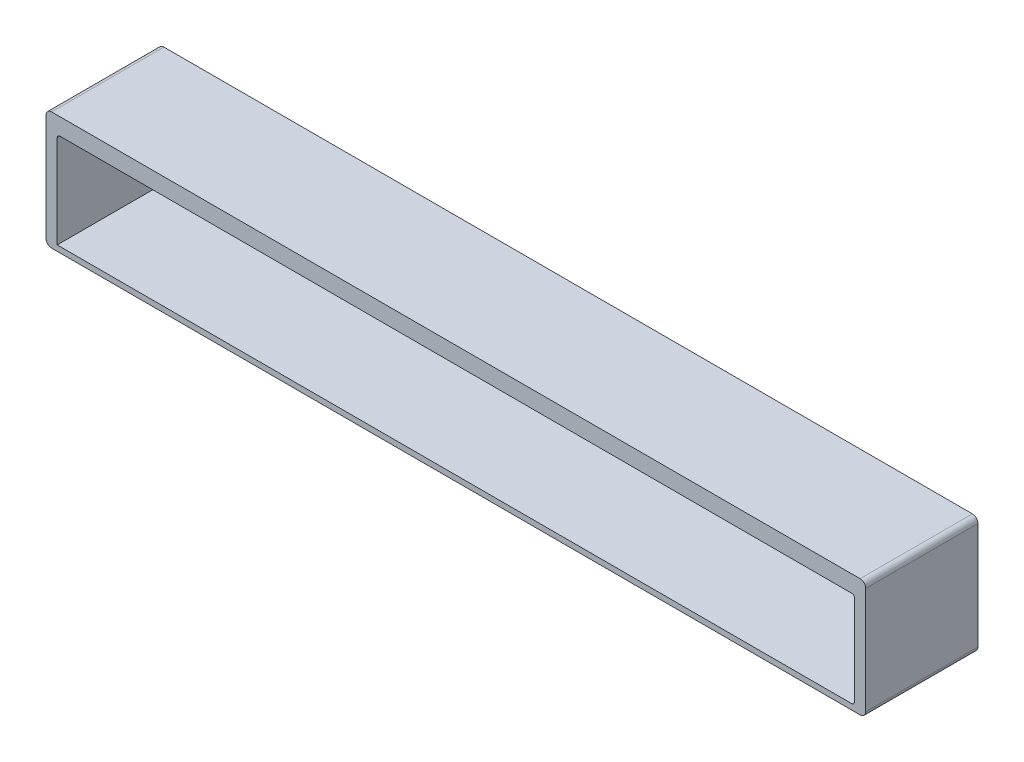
ISO-10303-21;
HEADER;
FILE_DESCRIPTION(('STEP AP214'),'2;1');
FILE_NAME('part.step','',(''),(''),'','','');
FILE_SCHEMA(('AUTOMOTIVE_DESIGN { 1 0 10303 214 1 1 1 1 }'));
ENDSEC;
DATA;
#1=APPLICATION_CONTEXT('core data for automotive mechanical design processes');
#2=APPLICATION_PROTOCOL_DEFINITION('international standard','automotive_design',2000,#1);
#3=PRODUCT_CONTEXT('',#1,'mechanical');
#4=PRODUCT('Part','Part','',(#3));
#5=PRODUCT_RELATED_PRODUCT_CATEGORY('part','',(#4));
#6=PRODUCT_DEFINITION_FORMATION('','',#4);
#7=PRODUCT_DEFINITION_CONTEXT('part definition',#1,'design');
#8=PRODUCT_DEFINITION('design','',#6,#7);
#9=PRODUCT_DEFINITION_SHAPE('','',#8);
#10=(LENGTH_UNIT() NAMED_UNIT(*) SI_UNIT(.MILLI.,.METRE.));
#11=(NAMED_UNIT(*) PLANE_ANGLE_UNIT() SI_UNIT($,.RADIAN.));
#12=(NAMED_UNIT(*) SI_UNIT($,.STERADIAN.) SOLID_ANGLE_UNIT());
#13=UNCERTAINTY_MEASURE_WITH_UNIT(LENGTH_MEASURE(1.E-05),#10,'distance_accuracy_value','');
#14=(GEOMETRIC_REPRESENTATION_CONTEXT(3) GLOBAL_UNCERTAINTY_ASSIGNED_CONTEXT((#13)) GLOBAL_UNIT_ASSIGNED_CONTEXT((#10,
#11,#12)) REPRESENTATION_CONTEXT('',''));
#15=CARTESIAN_POINT('',(0.,0.,0.));
#16=DIRECTION('',(0.,0.,1.));
#17=DIRECTION('',(1.,0.,0.));
#18=AXIS2_PLACEMENT_3D('',#15,#16,#17);
#19=CARTESIAN_POINT('',(-88.2099650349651,-6.1076923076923,-12.6188488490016));
#20=DIRECTION('',(0.,0.,-1.));
#21=DIRECTION('',(-1.,0.,0.));
#22=AXIS2_PLACEMENT_3D('',#19,#20,#21);
#23=PLANE('',#22);
#24=DIRECTION('',(0.,1.,0.));
#25=VECTOR('',#24,1.);
#26=CARTESIAN_POINT('',(-19.2099650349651,-104.00394301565,-12.6188488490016));
#27=LINE('',#26,#25);
#28=CARTESIAN_POINT('',(-19.2099650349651,-15.8670699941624,-12.6188488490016));
#29=VERTEX_POINT('',#28);
#30=CARTESIAN_POINT('',(-19.2099650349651,-7.8576923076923,-12.6188488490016));
#31=VERTEX_POINT('',#30);
#32=EDGE_CURVE('E180',#29,#31,#27,.T.);
#33=ORIENTED_EDGE('',*,*,#32,.F.);
#34=CARTESIAN_POINT('',(-19.4599650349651,-15.8670699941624,-12.6188488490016));
#35=DIRECTION('',(0.,0.,-1.));
#36=DIRECTION('',(-1.,0.,0.));
#37=AXIS2_PLACEMENT_3D('',#34,#35,#36);
#38=CIRCLE('',#37,0.25);
#39=CARTESIAN_POINT('',(-19.4599650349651,-16.1170699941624,-12.6188488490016));
#40=VERTEX_POINT('',#39);
#41=EDGE_CURVE('E142',#29,#40,#38,.T.);
#42=ORIENTED_EDGE('',*,*,#41,.T.);
#43=DIRECTION('',(-1.,0.,0.));
#44=VECTOR('',#43,1.);
#45=CARTESIAN_POINT('',(-18.2099650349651,-16.1170699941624,-12.6188488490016));
#46=LINE('',#45,#44);
#47=CARTESIAN_POINT('',(-90.2099650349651,-16.1170699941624,-12.6188488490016));
#48=VERTEX_POINT('',#47);
#49=EDGE_CURVE('E136',#40,#48,#46,.T.);
#50=ORIENTED_EDGE('',*,*,#49,.T.);
#51=DIRECTION('',(0.,1.,0.));
#52=VECTOR('',#51,1.);
#53=CARTESIAN_POINT('',(-90.2099650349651,-104.00394301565,-12.6188488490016));
#54=LINE('',#53,#52);
#55=CARTESIAN_POINT('',(-90.2099650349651,-7.8576923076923,-12.6188488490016));
#56=VERTEX_POINT('',#55);
#57=EDGE_CURVE('E140',#48,#56,#54,.T.);
#58=ORIENTED_EDGE('',*,*,#57,.T.);
#59=CARTESIAN_POINT('',(-89.9599650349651,-7.8576923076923,-12.6188488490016));
#60=DIRECTION('',(0.,0.,-1.));
#61=DIRECTION('',(-1.,0.,0.));
#62=AXIS2_PLACEMENT_3D('',#59,#60,#61);
#63=CIRCLE('',#62,0.25);
#64=CARTESIAN_POINT('',(-89.9599650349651,-7.60769230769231,-12.6188488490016));
#65=VERTEX_POINT('',#64);
#66=EDGE_CURVE('E411',#56,#65,#63,.T.);
#67=ORIENTED_EDGE('',*,*,#66,.T.);
#68=DIRECTION('',(1.,0.,0.));
#69=VECTOR('',#68,1.);
#70=CARTESIAN_POINT('',(-88.2099650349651,-7.60769230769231,-12.6188488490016));
#71=LINE('',#70,#69);
#72=CARTESIAN_POINT('',(-19.4599650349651,-7.60769230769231,-12.6188488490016));
#73=VERTEX_POINT('',#72);
#74=EDGE_CURVE('E162',#65,#73,#71,.T.);
#75=ORIENTED_EDGE('',*,*,#74,.T.);
#76=CARTESIAN_POINT('',(-19.4599650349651,-7.8576923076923,-12.6188488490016));
#77=DIRECTION('',(0.,0.,-1.));
#78=DIRECTION('',(-1.,0.,0.));
#79=AXIS2_PLACEMENT_3D('',#76,#77,#78);
#80=CIRCLE('',#79,0.25);
#81=EDGE_CURVE('E11',#73,#31,#80,.T.);
#82=ORIENTED_EDGE('',*,*,#81,.T.);
#83=EDGE_LOOP('',(#33,#42,#50,#58,#67,#75,#82));
#84=FACE_BOUND('',#83,.T.);
#85=DIRECTION('',(0.,1.,0.));
#86=VECTOR('',#85,1.);
#87=CARTESIAN_POINT('',(-18.2099650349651,-104.00394301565,-12.6188488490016));
#88=LINE('',#87,#86);
#89=CARTESIAN_POINT('',(-18.2099650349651,-16.1170699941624,-12.6188488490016));
#90=VERTEX_POINT('',#89);
#91=CARTESIAN_POINT('',(-18.2099650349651,-6.6076923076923,-12.6188488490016));
#92=VERTEX_POINT('',#91);
#93=EDGE_CURVE('E156',#90,#92,#88,.T.);
#94=ORIENTED_EDGE('',*,*,#93,.T.);
#95=CARTESIAN_POINT('',(-18.7099650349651,-6.6076923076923,-12.6188488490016));
#96=DIRECTION('',(0.,0.,-1.));
#97=DIRECTION('',(-1.,0.,0.));
#98=AXIS2_PLACEMENT_3D('',#95,#96,#97);
#99=CIRCLE('',#98,0.5);
#100=CARTESIAN_POINT('',(-18.7099650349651,-6.1076923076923,-12.6188488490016));
#101=VERTEX_POINT('',#100);
#102=EDGE_CURVE('E212',#92,#101,#99,.F.);
#103=ORIENTED_EDGE('',*,*,#102,.T.);
#104=DIRECTION('',(-1.,0.,0.));
#105=VECTOR('',#104,1.);
#106=CARTESIAN_POINT('',(-88.2099650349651,-6.1076923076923,-12.6188488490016));
#107=LINE('',#106,#105);
#108=CARTESIAN_POINT('',(-90.7099650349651,-6.1076923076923,-12.6188488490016));
#109=VERTEX_POINT('',#108);
#110=EDGE_CURVE('E165',#101,#109,#107,.T.);
#111=ORIENTED_EDGE('',*,*,#110,.T.);
#112=CARTESIAN_POINT('',(-90.7099650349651,-6.6076923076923,-12.6188488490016));
#113=DIRECTION('',(0.,0.,-1.));
#114=DIRECTION('',(-1.,0.,0.));
#115=AXIS2_PLACEMENT_3D('',#112,#113,#114);
#116=CIRCLE('',#115,0.5);
#117=CARTESIAN_POINT('',(-91.2099650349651,-6.6076923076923,-12.6188488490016));
#118=VERTEX_POINT('',#117);
#119=EDGE_CURVE('E210',#109,#118,#116,.F.);
#120=ORIENTED_EDGE('',*,*,#119,.T.);
#121=DIRECTION('',(0.,1.,0.));
#122=VECTOR('',#121,1.);
#123=CARTESIAN_POINT('',(-91.2099650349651,-104.00394301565,-12.6188488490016));
#124=LINE('',#123,#122);
#125=CARTESIAN_POINT('',(-91.2099650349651,-16.1170699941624,-12.6188488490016));
#126=VERTEX_POINT('',#125);
#127=EDGE_CURVE('E168',#126,#118,#124,.T.);
#128=ORIENTED_EDGE('',*,*,#127,.F.);
#129=CARTESIAN_POINT('',(-90.7099650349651,-16.1170699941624,-12.6188488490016));
#130=DIRECTION('',(0.,0.,-1.));
#131=DIRECTION('',(-1.,0.,0.));
#132=AXIS2_PLACEMENT_3D('',#129,#130,#131);
#133=CIRCLE('',#132,0.5);
#134=CARTESIAN_POINT('',(-90.7099650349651,-16.6170699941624,-12.6188488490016));
#135=VERTEX_POINT('',#134);
#136=EDGE_CURVE('E208',#126,#135,#133,.F.);
#137=ORIENTED_EDGE('',*,*,#136,.T.);
#138=DIRECTION('',(1.,0.,0.));
#139=VECTOR('',#138,1.);
#140=CARTESIAN_POINT('',(-90.2099650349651,-16.6170699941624,-12.6188488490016));
#141=LINE('',#140,#139);
#142=CARTESIAN_POINT('',(-18.7099650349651,-16.6170699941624,-12.6188488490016));
#143=VERTEX_POINT('',#142);
#144=EDGE_CURVE('E163',#135,#143,#141,.T.);
#145=ORIENTED_EDGE('',*,*,#144,.T.);
#146=CARTESIAN_POINT('',(-18.7099650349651,-16.1170699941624,-12.6188488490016));
#147=DIRECTION('',(0.,0.,-1.));
#148=DIRECTION('',(-1.,0.,0.));
#149=AXIS2_PLACEMENT_3D('',#146,#147,#148);
#150=CIRCLE('',#149,0.5);
#151=EDGE_CURVE('E206',#143,#90,#150,.F.);
#152=ORIENTED_EDGE('',*,*,#151,.T.);
#153=EDGE_LOOP('',(#94,#103,#111,#120,#128,#137,#145,#152));
#154=FACE_BOUND('',#153,.T.);
#155=ADVANCED_FACE('F30',(#84,#154),#23,.F.);
#156=CARTESIAN_POINT('',(-88.2099650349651,-7.60769230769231,-166.016788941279));
#157=DIRECTION('',(0.,-1.,0.));
#158=DIRECTION('',(0.,0.,-1.));
#159=AXIS2_PLACEMENT_3D('',#156,#157,#158);
#160=PLANE('',#159);
#161=ORIENTED_EDGE('',*,*,#74,.F.);
#162=DIRECTION('',(0.,0.,1.));
#163=VECTOR('',#162,1.);
#164=CARTESIAN_POINT('',(-89.9599650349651,-7.60769230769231,-22.6188488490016));
#165=LINE('',#164,#163);
#166=CARTESIAN_POINT('',(-89.9599650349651,-7.60769230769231,-22.6188488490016));
#167=VERTEX_POINT('',#166);
#168=EDGE_CURVE('E226',#65,#167,#165,.F.);
#169=ORIENTED_EDGE('',*,*,#168,.T.);
#170=DIRECTION('',(-1.,0.,0.));
#171=VECTOR('',#170,1.);
#172=CARTESIAN_POINT('',(-88.2099650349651,-7.60769230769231,-22.6188488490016));
#173=LINE('',#172,#171);
#174=CARTESIAN_POINT('',(-19.4599650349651,-7.60769230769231,-22.6188488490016));
#175=VERTEX_POINT('',#174);
#176=EDGE_CURVE('E242',#175,#167,#173,.T.);
#177=ORIENTED_EDGE('',*,*,#176,.F.);
#178=DIRECTION('',(0.,0.,-1.));
#179=VECTOR('',#178,1.);
#180=CARTESIAN_POINT('',(-19.4599650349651,-7.60769230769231,-12.6188488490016));
#181=LINE('',#180,#179);
#182=EDGE_CURVE('E223',#175,#73,#181,.F.);
#183=ORIENTED_EDGE('',*,*,#182,.T.);
#184=EDGE_LOOP('',(#161,#169,#177,#183));
#185=FACE_BOUND('',#184,.T.);
#186=ADVANCED_FACE('F301',(#185),#160,.T.);
#187=CARTESIAN_POINT('',(-88.2099650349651,-6.1076923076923,-166.016788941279));
#188=DIRECTION('',(0.,1.,0.));
#189=DIRECTION('',(0.,0.,1.));
#190=AXIS2_PLACEMENT_3D('',#187,#188,#189);
#191=PLANE('',#190);
#192=ORIENTED_EDGE('',*,*,#110,.F.);
#193=DIRECTION('',(0.,0.,-1.));
#194=VECTOR('',#193,1.);
#195=CARTESIAN_POINT('',(-18.7099650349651,-6.1076923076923,-166.016788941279));
#196=LINE('',#195,#194);
#197=CARTESIAN_POINT('',(-18.7099650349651,-6.1076923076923,-22.6188488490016));
#198=VERTEX_POINT('',#197);
#199=EDGE_CURVE('E186',#101,#198,#196,.T.);
#200=ORIENTED_EDGE('',*,*,#199,.T.);
#201=DIRECTION('',(1.,0.,0.));
#202=VECTOR('',#201,1.);
#203=CARTESIAN_POINT('',(-88.2099650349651,-6.1076923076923,-22.6188488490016));
#204=LINE('',#203,#202);
#205=CARTESIAN_POINT('',(-90.7099650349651,-6.1076923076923,-22.6188488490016));
#206=VERTEX_POINT('',#205);
#207=EDGE_CURVE('E147',#206,#198,#204,.T.);
#208=ORIENTED_EDGE('',*,*,#207,.F.);
#209=DIRECTION('',(0.,0.,1.));
#210=VECTOR('',#209,1.);
#211=CARTESIAN_POINT('',(-90.7099650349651,-6.1076923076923,-166.016788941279));
#212=LINE('',#211,#210);
#213=EDGE_CURVE('E183',#206,#109,#212,.T.);
#214=ORIENTED_EDGE('',*,*,#213,.T.);
#215=EDGE_LOOP('',(#192,#200,#208,#214));
#216=FACE_BOUND('',#215,.T.);
#217=ADVANCED_FACE('F266',(#216),#191,.T.);
#218=CARTESIAN_POINT('',(-98.7668120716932,-16.6170699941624,-99.));
#219=DIRECTION('',(0.,-1.,0.));
#220=DIRECTION('',(0.,0.,-1.));
#221=AXIS2_PLACEMENT_3D('',#218,#219,#220);
#222=PLANE('',#221);
#223=ORIENTED_EDGE('',*,*,#144,.F.);
#224=DIRECTION('',(0.,0.,1.));
#225=VECTOR('',#224,1.);
#226=CARTESIAN_POINT('',(-90.7099650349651,-16.6170699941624,-99.));
#227=LINE('',#226,#225);
#228=CARTESIAN_POINT('',(-90.7099650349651,-16.6170699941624,-22.6188488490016));
#229=VERTEX_POINT('',#228);
#230=EDGE_CURVE('E221',#135,#229,#227,.F.);
#231=ORIENTED_EDGE('',*,*,#230,.T.);
#232=DIRECTION('',(-1.,0.,0.));
#233=VECTOR('',#232,1.);
#234=CARTESIAN_POINT('',(-98.7668120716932,-16.6170699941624,-22.6188488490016));
#235=LINE('',#234,#233);
#236=CARTESIAN_POINT('',(-18.7099650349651,-16.6170699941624,-22.6188488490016));
#237=VERTEX_POINT('',#236);
#238=EDGE_CURVE('E239',#237,#229,#235,.T.);
#239=ORIENTED_EDGE('',*,*,#238,.F.);
#240=DIRECTION('',(0.,0.,-1.));
#241=VECTOR('',#240,1.);
#242=CARTESIAN_POINT('',(-18.7099650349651,-16.6170699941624,-99.));
#243=LINE('',#242,#241);
#244=EDGE_CURVE('E219',#237,#143,#243,.F.);
#245=ORIENTED_EDGE('',*,*,#244,.T.);
#246=EDGE_LOOP('',(#223,#231,#239,#245));
#247=FACE_BOUND('',#246,.T.);
#248=ADVANCED_FACE('F284',(#247),#222,.T.);
#249=CARTESIAN_POINT('',(-91.2099650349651,-104.00394301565,-12.6188488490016));
#250=DIRECTION('',(-1.,0.,0.));
#251=DIRECTION('',(0.,0.,1.));
#252=AXIS2_PLACEMENT_3D('',#249,#250,#251);
#253=PLANE('',#252);
#254=ORIENTED_EDGE('',*,*,#127,.T.);
#255=DIRECTION('',(0.,0.,1.));
#256=VECTOR('',#255,1.);
#257=CARTESIAN_POINT('',(-91.2099650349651,-6.6076923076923,-12.6188488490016));
#258=LINE('',#257,#256);
#259=CARTESIAN_POINT('',(-91.2099650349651,-6.6076923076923,-22.6188488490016));
#260=VERTEX_POINT('',#259);
#261=EDGE_CURVE('E217',#118,#260,#258,.F.);
#262=ORIENTED_EDGE('',*,*,#261,.T.);
#263=DIRECTION('',(0.,1.,0.));
#264=VECTOR('',#263,1.);
#265=CARTESIAN_POINT('',(-91.2099650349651,-40.6709312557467,-22.6188488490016));
#266=LINE('',#265,#264);
#267=CARTESIAN_POINT('',(-91.2099650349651,-16.1170699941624,-22.6188488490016));
#268=VERTEX_POINT('',#267);
#269=EDGE_CURVE('E251',#268,#260,#266,.T.);
#270=ORIENTED_EDGE('',*,*,#269,.F.);
#271=DIRECTION('',(0.,0.,1.));
#272=VECTOR('',#271,1.);
#273=CARTESIAN_POINT('',(-91.2099650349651,-16.1170699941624,-12.6188488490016));
#274=LINE('',#273,#272);
#275=EDGE_CURVE('E214',#268,#126,#274,.T.);
#276=ORIENTED_EDGE('',*,*,#275,.T.);
#277=EDGE_LOOP('',(#254,#262,#270,#276));
#278=FACE_BOUND('',#277,.T.);
#279=ADVANCED_FACE('F275',(#278),#253,.T.);
#280=CARTESIAN_POINT('',(-90.2099650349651,-104.00394301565,-12.6188488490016));
#281=DIRECTION('',(1.,0.,0.));
#282=DIRECTION('',(0.,0.,-1.));
#283=AXIS2_PLACEMENT_3D('',#280,#281,#282);
#284=PLANE('',#283);
#285=DIRECTION('',(0.,-1.,0.));
#286=VECTOR('',#285,1.);
#287=CARTESIAN_POINT('',(-90.2099650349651,-104.00394301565,-22.6188488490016));
#288=LINE('',#287,#286);
#289=CARTESIAN_POINT('',(-90.2099650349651,-7.8576923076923,-22.6188488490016));
#290=VERTEX_POINT('',#289);
#291=CARTESIAN_POINT('',(-90.2099650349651,-16.1170699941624,-22.6188488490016));
#292=VERTEX_POINT('',#291);
#293=EDGE_CURVE('E245',#290,#292,#288,.T.);
#294=ORIENTED_EDGE('',*,*,#293,.F.);
#295=DIRECTION('',(0.,0.,1.));
#296=VECTOR('',#295,1.);
#297=CARTESIAN_POINT('',(-90.2099650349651,-7.8576923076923,-12.6188488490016));
#298=LINE('',#297,#296);
#299=EDGE_CURVE('E161',#290,#56,#298,.T.);
#300=ORIENTED_EDGE('',*,*,#299,.T.);
#301=ORIENTED_EDGE('',*,*,#57,.F.);
#302=DIRECTION('',(0.,0.,1.));
#303=VECTOR('',#302,1.);
#304=CARTESIAN_POINT('',(-90.2099650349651,-16.1170699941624,-12.6188488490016));
#305=LINE('',#304,#303);
#306=EDGE_CURVE('E146',#292,#48,#305,.T.);
#307=ORIENTED_EDGE('',*,*,#306,.F.);
#308=EDGE_LOOP('',(#294,#300,#301,#307));
#309=FACE_BOUND('',#308,.T.);
#310=ADVANCED_FACE('F159',(#309),#284,.T.);
#311=CARTESIAN_POINT('',(-18.2099650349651,-104.00394301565,-12.6188488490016));
#312=DIRECTION('',(1.,0.,0.));
#313=DIRECTION('',(0.,0.,-1.));
#314=AXIS2_PLACEMENT_3D('',#311,#312,#313);
#315=PLANE('',#314);
#316=DIRECTION('',(0.,1.,0.));
#317=VECTOR('',#316,1.);
#318=CARTESIAN_POINT('',(-18.2099650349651,-40.6709312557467,-22.6188488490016));
#319=LINE('',#318,#317);
#320=CARTESIAN_POINT('',(-18.2099650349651,-16.1170699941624,-22.6188488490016));
#321=VERTEX_POINT('',#320);
#322=CARTESIAN_POINT('',(-18.2099650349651,-6.6076923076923,-22.6188488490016));
#323=VERTEX_POINT('',#322);
#324=EDGE_CURVE('E250',#321,#323,#319,.T.);
#325=ORIENTED_EDGE('',*,*,#324,.T.);
#326=DIRECTION('',(0.,0.,-1.));
#327=VECTOR('',#326,1.);
#328=CARTESIAN_POINT('',(-18.2099650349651,-6.6076923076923,-12.6188488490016));
#329=LINE('',#328,#327);
#330=EDGE_CURVE('E204',#323,#92,#329,.F.);
#331=ORIENTED_EDGE('',*,*,#330,.T.);
#332=ORIENTED_EDGE('',*,*,#93,.F.);
#333=DIRECTION('',(0.,0.,-1.));
#334=VECTOR('',#333,1.);
#335=CARTESIAN_POINT('',(-18.2099650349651,-16.1170699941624,-12.6188488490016));
#336=LINE('',#335,#334);
#337=EDGE_CURVE('E201',#90,#321,#336,.T.);
#338=ORIENTED_EDGE('',*,*,#337,.T.);
#339=EDGE_LOOP('',(#325,#331,#332,#338));
#340=FACE_BOUND('',#339,.T.);
#341=ADVANCED_FACE('F258',(#340),#315,.T.);
#342=CARTESIAN_POINT('',(-19.2099650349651,-104.00394301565,-12.6188488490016));
#343=DIRECTION('',(-1.,0.,0.));
#344=DIRECTION('',(0.,0.,1.));
#345=AXIS2_PLACEMENT_3D('',#342,#343,#344);
#346=PLANE('',#345);
#347=DIRECTION('',(0.,1.,0.));
#348=VECTOR('',#347,1.);
#349=CARTESIAN_POINT('',(-19.2099650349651,-104.00394301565,-22.6188488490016));
#350=LINE('',#349,#348);
#351=CARTESIAN_POINT('',(-19.2099650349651,-15.8670699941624,-22.6188488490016));
#352=VERTEX_POINT('',#351);
#353=CARTESIAN_POINT('',(-19.2099650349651,-7.8576923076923,-22.6188488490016));
#354=VERTEX_POINT('',#353);
#355=EDGE_CURVE('E247',#352,#354,#350,.T.);
#356=ORIENTED_EDGE('',*,*,#355,.F.);
#357=DIRECTION('',(0.,0.,-1.));
#358=VECTOR('',#357,1.);
#359=CARTESIAN_POINT('',(-19.2099650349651,-15.8670699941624,-12.6188488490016));
#360=LINE('',#359,#358);
#361=EDGE_CURVE('E50',#352,#29,#360,.F.);
#362=ORIENTED_EDGE('',*,*,#361,.T.);
#363=ORIENTED_EDGE('',*,*,#32,.T.);
#364=DIRECTION('',(0.,0.,-1.));
#365=VECTOR('',#364,1.);
#366=CARTESIAN_POINT('',(-19.2099650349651,-7.8576923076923,-22.6188488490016));
#367=LINE('',#366,#365);
#368=EDGE_CURVE('E230',#31,#354,#367,.T.);
#369=ORIENTED_EDGE('',*,*,#368,.T.);
#370=EDGE_LOOP('',(#356,#362,#363,#369));
#371=FACE_BOUND('',#370,.T.);
#372=ADVANCED_FACE('F362',(#371),#346,.T.);
#373=CARTESIAN_POINT('',(-18.2099650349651,-16.1170699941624,-173.001712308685));
#374=DIRECTION('',(0.,1.,0.));
#375=DIRECTION('',(-1.,0.,0.));
#376=AXIS2_PLACEMENT_3D('',#373,#374,#375);
#377=PLANE('',#376);
#378=ORIENTED_EDGE('',*,*,#49,.F.);
#379=DIRECTION('',(0.,0.,-1.));
#380=VECTOR('',#379,1.);
#381=CARTESIAN_POINT('',(-19.4599650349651,-16.1170699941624,-22.6188488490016));
#382=LINE('',#381,#380);
#383=CARTESIAN_POINT('',(-19.4599650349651,-16.1170699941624,-22.6188488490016));
#384=VERTEX_POINT('',#383);
#385=EDGE_CURVE('E228',#40,#384,#382,.T.);
#386=ORIENTED_EDGE('',*,*,#385,.T.);
#387=DIRECTION('',(1.,0.,0.));
#388=VECTOR('',#387,1.);
#389=CARTESIAN_POINT('',(-18.2099650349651,-16.1170699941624,-22.6188488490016));
#390=LINE('',#389,#388);
#391=EDGE_CURVE('E153',#292,#384,#390,.T.);
#392=ORIENTED_EDGE('',*,*,#391,.F.);
#393=ORIENTED_EDGE('',*,*,#306,.T.);
#394=EDGE_LOOP('',(#378,#386,#392,#393));
#395=FACE_BOUND('',#394,.T.);
#396=ADVANCED_FACE('F151',(#395),#377,.T.);
#397=CARTESIAN_POINT('',(-18.2099650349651,-40.6709312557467,-22.6188488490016));
#398=DIRECTION('',(0.,0.,1.));
#399=DIRECTION('',(1.,0.,0.));
#400=AXIS2_PLACEMENT_3D('',#397,#398,#399);
#401=PLANE('',#400);
#402=ORIENTED_EDGE('',*,*,#207,.T.);
#403=CARTESIAN_POINT('',(-18.7099650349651,-6.6076923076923,-22.6188488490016));
#404=DIRECTION('',(0.,0.,1.));
#405=DIRECTION('',(1.,0.,0.));
#406=AXIS2_PLACEMENT_3D('',#403,#404,#405);
#407=CIRCLE('',#406,0.5);
#408=EDGE_CURVE('E199',#198,#323,#407,.F.);
#409=ORIENTED_EDGE('',*,*,#408,.T.);
#410=ORIENTED_EDGE('',*,*,#324,.F.);
#411=CARTESIAN_POINT('',(-18.7099650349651,-16.1170699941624,-22.6188488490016));
#412=DIRECTION('',(0.,0.,1.));
#413=DIRECTION('',(1.,0.,0.));
#414=AXIS2_PLACEMENT_3D('',#411,#412,#413);
#415=CIRCLE('',#414,0.5);
#416=EDGE_CURVE('E191',#321,#237,#415,.F.);
#417=ORIENTED_EDGE('',*,*,#416,.T.);
#418=ORIENTED_EDGE('',*,*,#238,.T.);
#419=CARTESIAN_POINT('',(-90.7099650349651,-16.1170699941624,-22.6188488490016));
#420=DIRECTION('',(0.,0.,1.));
#421=DIRECTION('',(1.,0.,0.));
#422=AXIS2_PLACEMENT_3D('',#419,#420,#421);
#423=CIRCLE('',#422,0.5);
#424=EDGE_CURVE('E195',#229,#268,#423,.F.);
#425=ORIENTED_EDGE('',*,*,#424,.T.);
#426=ORIENTED_EDGE('',*,*,#269,.T.);
#427=CARTESIAN_POINT('',(-90.7099650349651,-6.6076923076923,-22.6188488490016));
#428=DIRECTION('',(0.,0.,1.));
#429=DIRECTION('',(1.,0.,0.));
#430=AXIS2_PLACEMENT_3D('',#427,#428,#429);
#431=CIRCLE('',#430,0.5);
#432=EDGE_CURVE('E197',#260,#206,#431,.F.);
#433=ORIENTED_EDGE('',*,*,#432,.T.);
#434=EDGE_LOOP('',(#402,#409,#410,#417,#418,#425,#426,#433));
#435=FACE_BOUND('',#434,.T.);
#436=ORIENTED_EDGE('',*,*,#355,.T.);
#437=CARTESIAN_POINT('',(-19.4599650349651,-7.8576923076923,-22.6188488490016));
#438=DIRECTION('',(0.,0.,1.));
#439=DIRECTION('',(1.,0.,0.));
#440=AXIS2_PLACEMENT_3D('',#437,#438,#439);
#441=CIRCLE('',#440,0.25);
#442=EDGE_CURVE('E38',#354,#175,#441,.T.);
#443=ORIENTED_EDGE('',*,*,#442,.T.);
#444=ORIENTED_EDGE('',*,*,#176,.T.);
#445=CARTESIAN_POINT('',(-89.9599650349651,-7.8576923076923,-22.6188488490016));
#446=DIRECTION('',(0.,0.,1.));
#447=DIRECTION('',(1.,0.,0.));
#448=AXIS2_PLACEMENT_3D('',#445,#446,#447);
#449=CIRCLE('',#448,0.25);
#450=EDGE_CURVE('E412',#167,#290,#449,.T.);
#451=ORIENTED_EDGE('',*,*,#450,.T.);
#452=ORIENTED_EDGE('',*,*,#293,.T.);
#453=ORIENTED_EDGE('',*,*,#391,.T.);
#454=CARTESIAN_POINT('',(-19.4599650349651,-15.8670699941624,-22.6188488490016));
#455=DIRECTION('',(0.,0.,1.));
#456=DIRECTION('',(1.,0.,0.));
#457=AXIS2_PLACEMENT_3D('',#454,#455,#456);
#458=CIRCLE('',#457,0.25);
#459=EDGE_CURVE('E416',#384,#352,#458,.T.);
#460=ORIENTED_EDGE('',*,*,#459,.T.);
#461=EDGE_LOOP('',(#436,#443,#444,#451,#452,#453,#460));
#462=FACE_BOUND('',#461,.T.);
#463=ADVANCED_FACE('F267',(#435,#462),#401,.F.);
#464=CARTESIAN_POINT('',(-18.7099650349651,-6.6076923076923,-166.016788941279));
#465=DIRECTION('',(0.,0.,-1.));
#466=DIRECTION('',(-1.,0.,0.));
#467=AXIS2_PLACEMENT_3D('',#464,#465,#466);
#468=CYLINDRICAL_SURFACE('',#467,0.5);
#469=ORIENTED_EDGE('',*,*,#102,.F.);
#470=ORIENTED_EDGE('',*,*,#330,.F.);
#471=ORIENTED_EDGE('',*,*,#408,.F.);
#472=ORIENTED_EDGE('',*,*,#199,.F.);
#473=EDGE_LOOP('',(#469,#470,#471,#472));
#474=FACE_BOUND('',#473,.T.);
#475=ADVANCED_FACE('F264',(#474),#468,.T.);
#476=CARTESIAN_POINT('',(-90.7099650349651,-6.6076923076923,-166.016788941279));
#477=DIRECTION('',(0.,0.,1.));
#478=DIRECTION('',(1.,0.,0.));
#479=AXIS2_PLACEMENT_3D('',#476,#477,#478);
#480=CYLINDRICAL_SURFACE('',#479,0.5);
#481=ORIENTED_EDGE('',*,*,#432,.F.);
#482=ORIENTED_EDGE('',*,*,#261,.F.);
#483=ORIENTED_EDGE('',*,*,#119,.F.);
#484=ORIENTED_EDGE('',*,*,#213,.F.);
#485=EDGE_LOOP('',(#481,#482,#483,#484));
#486=FACE_BOUND('',#485,.T.);
#487=ADVANCED_FACE('F272',(#486),#480,.T.);
#488=CARTESIAN_POINT('',(-90.7099650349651,-16.1170699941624,-12.6188488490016));
#489=DIRECTION('',(0.,0.,1.));
#490=DIRECTION('',(1.,0.,0.));
#491=AXIS2_PLACEMENT_3D('',#488,#489,#490);
#492=CYLINDRICAL_SURFACE('',#491,0.5);
#493=ORIENTED_EDGE('',*,*,#424,.F.);
#494=ORIENTED_EDGE('',*,*,#230,.F.);
#495=ORIENTED_EDGE('',*,*,#136,.F.);
#496=ORIENTED_EDGE('',*,*,#275,.F.);
#497=EDGE_LOOP('',(#493,#494,#495,#496));
#498=FACE_BOUND('',#497,.T.);
#499=ADVANCED_FACE('F279',(#498),#492,.T.);
#500=CARTESIAN_POINT('',(-18.7099650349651,-16.1170699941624,-12.6188488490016));
#501=DIRECTION('',(0.,0.,-1.));
#502=DIRECTION('',(-1.,0.,0.));
#503=AXIS2_PLACEMENT_3D('',#500,#501,#502);
#504=CYLINDRICAL_SURFACE('',#503,0.5);
#505=ORIENTED_EDGE('',*,*,#151,.F.);
#506=ORIENTED_EDGE('',*,*,#244,.F.);
#507=ORIENTED_EDGE('',*,*,#416,.F.);
#508=ORIENTED_EDGE('',*,*,#337,.F.);
#509=EDGE_LOOP('',(#505,#506,#507,#508));
#510=FACE_BOUND('',#509,.T.);
#511=ADVANCED_FACE('F288',(#510),#504,.T.);
#512=CARTESIAN_POINT('',(-89.9599650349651,-7.8576923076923,-12.6188488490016));
#513=DIRECTION('',(0.,0.,-1.));
#514=DIRECTION('',(-1.,0.,0.));
#515=AXIS2_PLACEMENT_3D('',#512,#513,#514);
#516=CYLINDRICAL_SURFACE('',#515,0.25);
#517=ORIENTED_EDGE('',*,*,#450,.F.);
#518=ORIENTED_EDGE('',*,*,#168,.F.);
#519=ORIENTED_EDGE('',*,*,#66,.F.);
#520=ORIENTED_EDGE('',*,*,#299,.F.);
#521=EDGE_LOOP('',(#517,#518,#519,#520));
#522=FACE_BOUND('',#521,.T.);
#523=ADVANCED_FACE('F290',(#522),#516,.F.);
#524=CARTESIAN_POINT('',(-19.4599650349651,-15.8670699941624,-173.001712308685));
#525=DIRECTION('',(0.,0.,1.));
#526=DIRECTION('',(1.,0.,0.));
#527=AXIS2_PLACEMENT_3D('',#524,#525,#526);
#528=CYLINDRICAL_SURFACE('',#527,0.25);
#529=ORIENTED_EDGE('',*,*,#41,.F.);
#530=ORIENTED_EDGE('',*,*,#361,.F.);
#531=ORIENTED_EDGE('',*,*,#459,.F.);
#532=ORIENTED_EDGE('',*,*,#385,.F.);
#533=EDGE_LOOP('',(#529,#530,#531,#532));
#534=FACE_BOUND('',#533,.T.);
#535=ADVANCED_FACE('F296',(#534),#528,.F.);
#536=CARTESIAN_POINT('',(-19.4599650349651,-7.8576923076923,-12.6188488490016));
#537=DIRECTION('',(0.,0.,1.));
#538=DIRECTION('',(1.,0.,0.));
#539=AXIS2_PLACEMENT_3D('',#536,#537,#538);
#540=CYLINDRICAL_SURFACE('',#539,0.25);
#541=ORIENTED_EDGE('',*,*,#81,.F.);
#542=ORIENTED_EDGE('',*,*,#182,.F.);
#543=ORIENTED_EDGE('',*,*,#442,.F.);
#544=ORIENTED_EDGE('',*,*,#368,.F.);
#545=EDGE_LOOP('',(#541,#542,#543,#544));
#546=FACE_BOUND('',#545,.T.);
#547=ADVANCED_FACE('F32',(#546),#540,.F.);
#548=CLOSED_SHELL('',(#155,#186,#217,#248,#279,#310,#341,#372,#396,#463,#475,#487,#499,#511,
#523,#535,#547));
#549=MANIFOLD_SOLID_BREP('B2',#548);
#550=ADVANCED_BREP_SHAPE_REPRESENTATION('',(#18,#549),#14);
#551=SHAPE_DEFINITION_REPRESENTATION(#9,#550);
ENDSEC;
END-ISO-10303-21;
